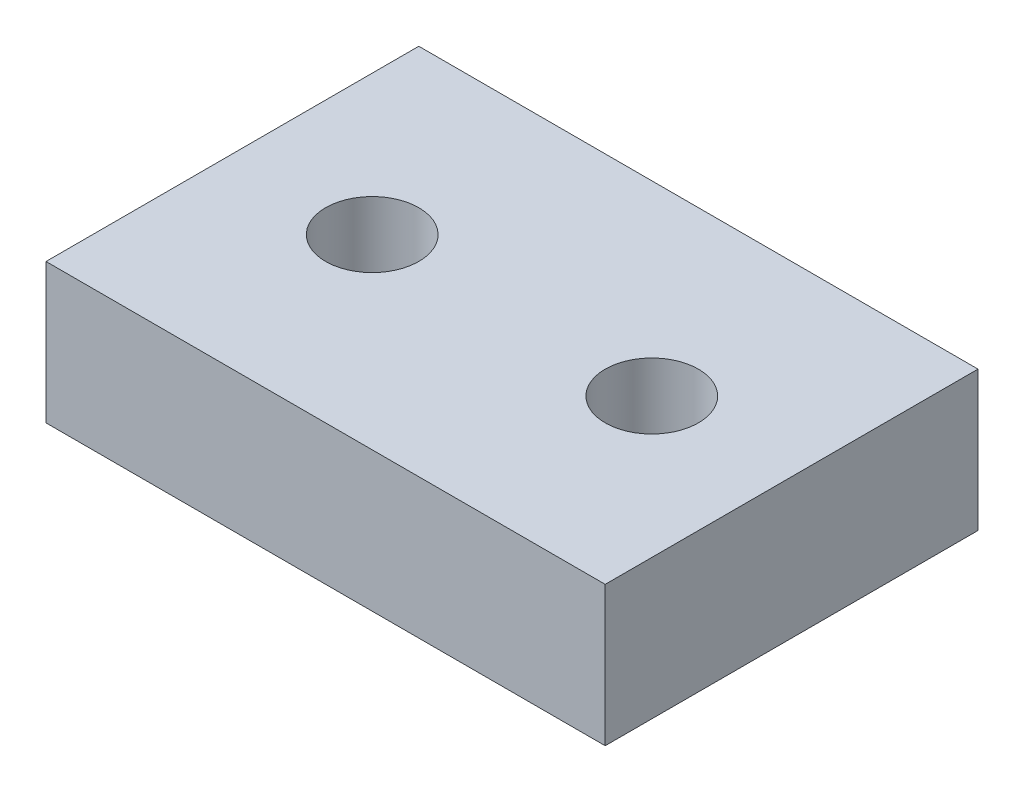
from build123d import *

# Parameters (mm, degrees)
SKETCH1_W          = 76.2
SKETCH1_H          = 19.05
BASE_EXTRUDE_DEPTH = 50.8
SKETCH2_R          = 6.35
CUT_EXTRUDE1_DEPTH = 94.541341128


with BuildPart() as part:
    # Sketch1 → Base-Extrude (new body)
    with BuildSketch(Plane.XY):
        with Locations((38.1, 9.525)):
            Rectangle(SKETCH1_W, SKETCH1_H)
    extrude(amount=BASE_EXTRUDE_DEPTH)

    # Sketch2 → Cut-Extrude1 (cut, through all)
    with BuildSketch(Plane(origin=(0, 19.05, 0), x_dir=(-1, 0, 0), z_dir=(0, 1, 0))):
        with Locations((-57.15, 25.4)):
            Circle(SKETCH2_R)
        with Locations((-19.05, 25.4)):
            Circle(SKETCH2_R)
    extrude(amount=-CUT_EXTRUDE1_DEPTH, mode=Mode.SUBTRACT)


solid = part.part
